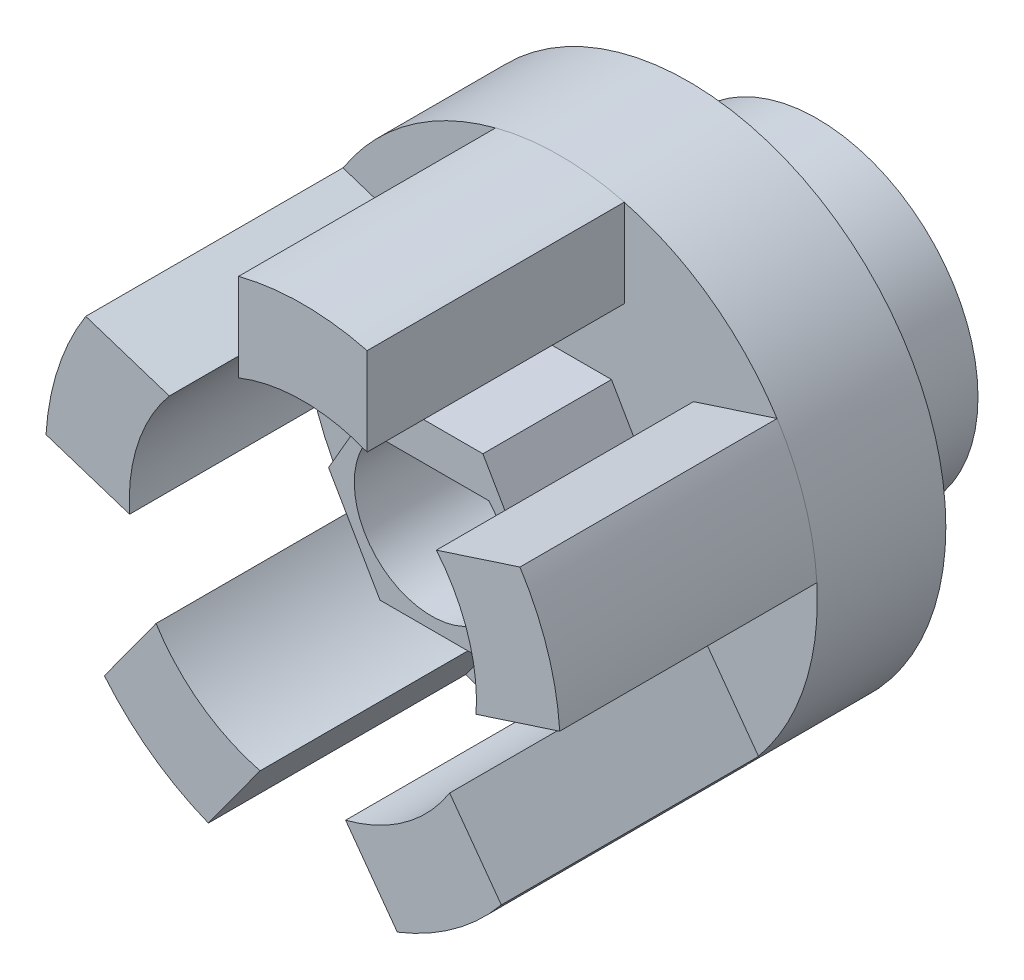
from build123d import *

# Parameters (mm, degrees)
SKETCH1_R           = 3.175
BOSS_EXTRUDE1_DEPTH = 5.08
BOSS_EXTRUDE2_DEPTH = 2.54
CUT_EXTRUDE1_DEPTH  = 7.62
BOSS_EXTRUDE3_START = -2.54
SKETCH5_R           = 5.08
SKETCH5_R_2         = 3.175
BOSS_EXTRUDE3_DEPTH = 2.54
BOSS_EXTRUDE4_DEPTH = 5.08


with BuildPart() as part:
    # Sketch1 → Boss-Extrude1 (new body)
    with BuildSketch(Plane.XY):
        Circle(SKETCH1_R)
    extrude(amount=BOSS_EXTRUDE1_DEPTH)

    # Sketch2 → Boss-Extrude2 (add)
    with BuildSketch(Plane.XY.offset(5.08)):
        Polygon((2.032, 0), (1.016, 1.75976362), (-1.016, 1.75976362), (-2.032, 0), (-1.016, -1.75976362), (1.016, -1.75976362), align=None)
    extrude(amount=BOSS_EXTRUDE2_DEPTH)

    # Sketch3 → Cut-Extrude1 (cut)
    with BuildSketch(Plane(origin=(0, 0, 0), x_dir=(-1, 0, 0), z_dir=(0, 0, -1))):
        with BuildLine():
            Line((-1.135922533, 1.016), (1.135922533, 1.016))
            ThreePointArc((1.135922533, 1.016), (0, -1.524), (-1.135922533, 1.016))
        make_face()
    extrude(amount=-CUT_EXTRUDE1_DEPTH, mode=Mode.SUBTRACT)

    # Sketch5 → Boss-Extrude3 (add)
    with BuildSketch(Plane.XY.offset(5.08).offset(BOSS_EXTRUDE3_START)):
        Circle(SKETCH5_R)
        Circle(SKETCH5_R_2, mode=Mode.SUBTRACT)
    extrude(amount=BOSS_EXTRUDE3_DEPTH)

    # Sketch6 → Boss-Extrude4 (add)
    with BuildSketch(Plane.XY.offset(5.08)):
        with BuildLine():
            Line((-1.27, 4.921461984), (-1.27, 3.185143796))
            ThreePointArc((-1.27, 3.185143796), (0, 3.429), (1.27, 3.185143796))
            Line((1.27, 3.185143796), (1.27, 4.921461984))
            ThreePointArc((1.27, 4.921461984), (0, 5.082685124), (-1.27, 4.921461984))
        make_face()
        with BuildLine():
            Line((4.288136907, 2.728657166), (2.636800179, 2.192105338))
            ThreePointArc((2.636800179, 2.192105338), (3.261172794, 1.059619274), (3.421703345, -0.223578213))
            Line((3.421703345, -0.223578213), (5.073040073, 0.312973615))
            ThreePointArc((5.073040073, 0.312973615), (4.833920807, 1.57063608), (4.288136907, 2.728657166))
        make_face()
        with BuildLine():
            Line((3.920214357, -3.235059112), (2.899632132, -1.83034819))
            ThreePointArc((2.899632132, -1.83034819), (2.01551563, -2.774119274), (0.844728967, -3.323322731))
            Line((0.844728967, -3.323322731), (1.865311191, -4.728033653))
            ThreePointArc((1.865311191, -4.728033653), (2.987527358, -4.111978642), (3.920214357, -3.235059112))
        make_face()
        with BuildLine():
            Line((-1.865311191, -4.728033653), (-0.844728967, -3.323322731))
            ThreePointArc((-0.844728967, -3.323322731), (-2.01551563, -2.774119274), (-2.899632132, -1.83034819))
            Line((-2.899632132, -1.83034819), (-3.920214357, -3.235059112))
            ThreePointArc((-3.920214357, -3.235059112), (-2.987527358, -4.111978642), (-1.865311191, -4.728033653))
        make_face()
        with BuildLine():
            Line((-5.073040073, 0.312973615), (-3.421703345, -0.223578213))
            ThreePointArc((-3.421703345, -0.223578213), (-3.261172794, 1.059619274), (-2.636800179, 2.192105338))
            Line((-2.636800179, 2.192105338), (-4.288136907, 2.728657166))
            ThreePointArc((-4.288136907, 2.728657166), (-4.833920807, 1.57063608), (-5.073040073, 0.312973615))
        make_face()
    extrude(amount=BOSS_EXTRUDE4_DEPTH)


solid = part.part
